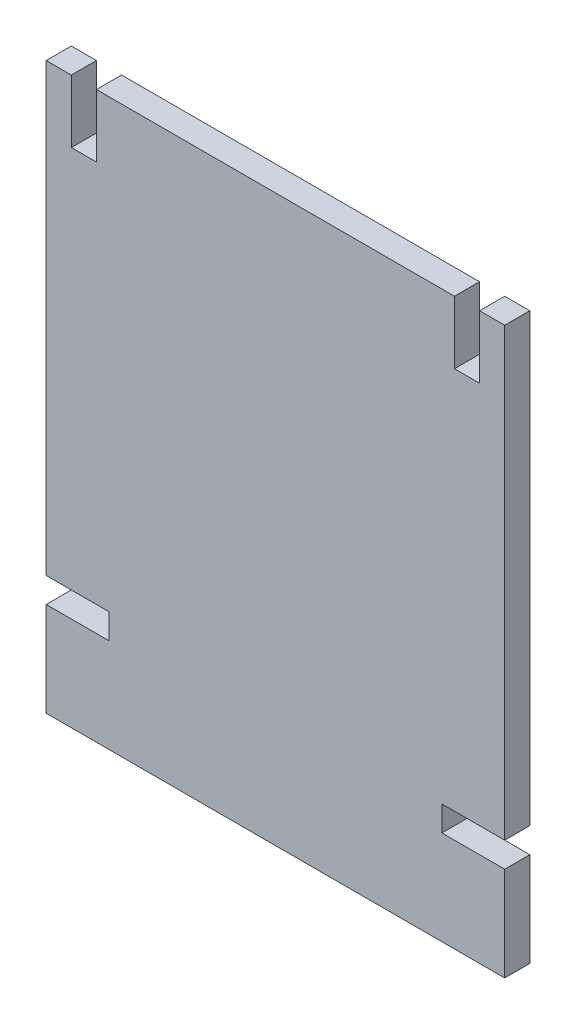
ISO-10303-21;
HEADER;
FILE_DESCRIPTION(('STEP AP214'),'2;1');
FILE_NAME('part.step','',(''),(''),'','','');
FILE_SCHEMA(('AUTOMOTIVE_DESIGN { 1 0 10303 214 1 1 1 1 }'));
ENDSEC;
DATA;
#1=APPLICATION_CONTEXT('core data for automotive mechanical design processes');
#2=APPLICATION_PROTOCOL_DEFINITION('international standard','automotive_design',2000,#1);
#3=PRODUCT_CONTEXT('',#1,'mechanical');
#4=PRODUCT('Part','Part','',(#3));
#5=PRODUCT_RELATED_PRODUCT_CATEGORY('part','',(#4));
#6=PRODUCT_DEFINITION_FORMATION('','',#4);
#7=PRODUCT_DEFINITION_CONTEXT('part definition',#1,'design');
#8=PRODUCT_DEFINITION('design','',#6,#7);
#9=PRODUCT_DEFINITION_SHAPE('','',#8);
#10=(LENGTH_UNIT() NAMED_UNIT(*) SI_UNIT(.MILLI.,.METRE.));
#11=(NAMED_UNIT(*) PLANE_ANGLE_UNIT() SI_UNIT($,.RADIAN.));
#12=(NAMED_UNIT(*) SI_UNIT($,.STERADIAN.) SOLID_ANGLE_UNIT());
#13=UNCERTAINTY_MEASURE_WITH_UNIT(LENGTH_MEASURE(1.E-05),#10,'distance_accuracy_value','');
#14=(GEOMETRIC_REPRESENTATION_CONTEXT(3) GLOBAL_UNCERTAINTY_ASSIGNED_CONTEXT((#13)) GLOBAL_UNIT_ASSIGNED_CONTEXT((#10,
#11,#12)) REPRESENTATION_CONTEXT('',''));
#15=CARTESIAN_POINT('',(0.,0.,0.));
#16=DIRECTION('',(0.,0.,1.));
#17=DIRECTION('',(1.,0.,0.));
#18=AXIS2_PLACEMENT_3D('',#15,#16,#17);
#19=CARTESIAN_POINT('',(36.5,-30.,4.));
#20=DIRECTION('',(-1.,0.,0.));
#21=DIRECTION('',(0.,-1.,0.));
#22=AXIS2_PLACEMENT_3D('',#19,#20,#21);
#23=PLANE('',#22);
#24=DIRECTION('',(0.,1.,0.));
#25=VECTOR('',#24,1.);
#26=CARTESIAN_POINT('',(36.5,-30.,0.));
#27=LINE('',#26,#25);
#28=CARTESIAN_POINT('',(36.5,-45.,0.));
#29=VERTEX_POINT('',#28);
#30=CARTESIAN_POINT('',(36.5,-30.,0.));
#31=VERTEX_POINT('',#30);
#32=EDGE_CURVE('E199',#29,#31,#27,.T.);
#33=ORIENTED_EDGE('',*,*,#32,.T.);
#34=DIRECTION('',(0.,0.,-1.));
#35=VECTOR('',#34,1.);
#36=CARTESIAN_POINT('',(36.5,-30.,4.));
#37=LINE('',#36,#35);
#38=CARTESIAN_POINT('',(36.5,-30.,4.));
#39=VERTEX_POINT('',#38);
#40=EDGE_CURVE('E11',#39,#31,#37,.T.);
#41=ORIENTED_EDGE('',*,*,#40,.F.);
#42=DIRECTION('',(0.,1.,0.));
#43=VECTOR('',#42,1.);
#44=CARTESIAN_POINT('',(36.5,-30.,4.));
#45=LINE('',#44,#43);
#46=CARTESIAN_POINT('',(36.5,-45.,4.));
#47=VERTEX_POINT('',#46);
#48=EDGE_CURVE('E237',#47,#39,#45,.T.);
#49=ORIENTED_EDGE('',*,*,#48,.F.);
#50=DIRECTION('',(0.,0.,-1.));
#51=VECTOR('',#50,1.);
#52=CARTESIAN_POINT('',(36.5,-45.,4.));
#53=LINE('',#52,#51);
#54=EDGE_CURVE('E195',#47,#29,#53,.T.);
#55=ORIENTED_EDGE('',*,*,#54,.T.);
#56=EDGE_LOOP('',(#33,#41,#49,#55));
#57=FACE_BOUND('',#56,.T.);
#58=ADVANCED_FACE('F31',(#57),#23,.F.);
#59=CARTESIAN_POINT('',(36.5,-30.,4.));
#60=DIRECTION('',(0.,-1.,0.));
#61=DIRECTION('',(0.,0.,-1.));
#62=AXIS2_PLACEMENT_3D('',#59,#60,#61);
#63=PLANE('',#62);
#64=DIRECTION('',(-1.,0.,0.));
#65=VECTOR('',#64,1.);
#66=CARTESIAN_POINT('',(36.5,-30.,0.));
#67=LINE('',#66,#65);
#68=CARTESIAN_POINT('',(26.5,-30.,0.));
#69=VERTEX_POINT('',#68);
#70=EDGE_CURVE('E202',#31,#69,#67,.T.);
#71=ORIENTED_EDGE('',*,*,#70,.T.);
#72=DIRECTION('',(0.,0.,-1.));
#73=VECTOR('',#72,1.);
#74=CARTESIAN_POINT('',(26.5,-30.,4.));
#75=LINE('',#74,#73);
#76=CARTESIAN_POINT('',(26.5,-30.,4.));
#77=VERTEX_POINT('',#76);
#78=EDGE_CURVE('E39',#77,#69,#75,.T.);
#79=ORIENTED_EDGE('',*,*,#78,.F.);
#80=DIRECTION('',(-1.,0.,0.));
#81=VECTOR('',#80,1.);
#82=CARTESIAN_POINT('',(36.5,-30.,4.));
#83=LINE('',#82,#81);
#84=EDGE_CURVE('E126',#39,#77,#83,.T.);
#85=ORIENTED_EDGE('',*,*,#84,.F.);
#86=ORIENTED_EDGE('',*,*,#40,.T.);
#87=EDGE_LOOP('',(#71,#79,#85,#86));
#88=FACE_BOUND('',#87,.T.);
#89=ADVANCED_FACE('F355',(#88),#63,.F.);
#90=CARTESIAN_POINT('',(26.5,-26.,4.));
#91=DIRECTION('',(-1.,0.,0.));
#92=DIRECTION('',(0.,0.,1.));
#93=AXIS2_PLACEMENT_3D('',#90,#91,#92);
#94=PLANE('',#93);
#95=DIRECTION('',(0.,1.,0.));
#96=VECTOR('',#95,1.);
#97=CARTESIAN_POINT('',(26.5,-26.,0.));
#98=LINE('',#97,#96);
#99=CARTESIAN_POINT('',(26.5,-26.,0.));
#100=VERTEX_POINT('',#99);
#101=EDGE_CURVE('E204',#69,#100,#98,.T.);
#102=ORIENTED_EDGE('',*,*,#101,.T.);
#103=DIRECTION('',(0.,0.,-1.));
#104=VECTOR('',#103,1.);
#105=CARTESIAN_POINT('',(26.5,-26.,4.));
#106=LINE('',#105,#104);
#107=CARTESIAN_POINT('',(26.5,-26.,4.));
#108=VERTEX_POINT('',#107);
#109=EDGE_CURVE('E280',#108,#100,#106,.T.);
#110=ORIENTED_EDGE('',*,*,#109,.F.);
#111=DIRECTION('',(0.,1.,0.));
#112=VECTOR('',#111,1.);
#113=CARTESIAN_POINT('',(26.5,-26.,4.));
#114=LINE('',#113,#112);
#115=EDGE_CURVE('E288',#77,#108,#114,.T.);
#116=ORIENTED_EDGE('',*,*,#115,.F.);
#117=ORIENTED_EDGE('',*,*,#78,.T.);
#118=EDGE_LOOP('',(#102,#110,#116,#117));
#119=FACE_BOUND('',#118,.T.);
#120=ADVANCED_FACE('F286',(#119),#94,.F.);
#121=CARTESIAN_POINT('',(36.5,-26.,4.));
#122=DIRECTION('',(0.,1.,0.));
#123=DIRECTION('',(0.,0.,1.));
#124=AXIS2_PLACEMENT_3D('',#121,#122,#123);
#125=PLANE('',#124);
#126=DIRECTION('',(1.,0.,0.));
#127=VECTOR('',#126,1.);
#128=CARTESIAN_POINT('',(36.5,-26.,0.));
#129=LINE('',#128,#127);
#130=CARTESIAN_POINT('',(36.5,-26.,0.));
#131=VERTEX_POINT('',#130);
#132=EDGE_CURVE('E206',#100,#131,#129,.T.);
#133=ORIENTED_EDGE('',*,*,#132,.T.);
#134=DIRECTION('',(0.,0.,-1.));
#135=VECTOR('',#134,1.);
#136=CARTESIAN_POINT('',(36.5,-26.,4.));
#137=LINE('',#136,#135);
#138=CARTESIAN_POINT('',(36.5,-26.,4.));
#139=VERTEX_POINT('',#138);
#140=EDGE_CURVE('E277',#139,#131,#137,.T.);
#141=ORIENTED_EDGE('',*,*,#140,.F.);
#142=DIRECTION('',(1.,0.,0.));
#143=VECTOR('',#142,1.);
#144=CARTESIAN_POINT('',(36.5,-26.,4.));
#145=LINE('',#144,#143);
#146=EDGE_CURVE('E306',#108,#139,#145,.T.);
#147=ORIENTED_EDGE('',*,*,#146,.F.);
#148=ORIENTED_EDGE('',*,*,#109,.T.);
#149=EDGE_LOOP('',(#133,#141,#147,#148));
#150=FACE_BOUND('',#149,.T.);
#151=ADVANCED_FACE('F297',(#150),#125,.F.);
#152=CARTESIAN_POINT('',(36.5,45.,4.));
#153=DIRECTION('',(-1.,0.,0.));
#154=DIRECTION('',(0.,-1.,0.));
#155=AXIS2_PLACEMENT_3D('',#152,#153,#154);
#156=PLANE('',#155);
#157=DIRECTION('',(0.,1.,0.));
#158=VECTOR('',#157,1.);
#159=CARTESIAN_POINT('',(36.5,45.,0.));
#160=LINE('',#159,#158);
#161=CARTESIAN_POINT('',(36.5,45.,0.));
#162=VERTEX_POINT('',#161);
#163=EDGE_CURVE('E208',#131,#162,#160,.T.);
#164=ORIENTED_EDGE('',*,*,#163,.T.);
#165=DIRECTION('',(0.,0.,-1.));
#166=VECTOR('',#165,1.);
#167=CARTESIAN_POINT('',(36.5,45.,4.));
#168=LINE('',#167,#166);
#169=CARTESIAN_POINT('',(36.5,45.,4.));
#170=VERTEX_POINT('',#169);
#171=EDGE_CURVE('E274',#170,#162,#168,.T.);
#172=ORIENTED_EDGE('',*,*,#171,.F.);
#173=DIRECTION('',(0.,1.,0.));
#174=VECTOR('',#173,1.);
#175=CARTESIAN_POINT('',(36.5,45.,4.));
#176=LINE('',#175,#174);
#177=EDGE_CURVE('E303',#139,#170,#176,.T.);
#178=ORIENTED_EDGE('',*,*,#177,.F.);
#179=ORIENTED_EDGE('',*,*,#140,.T.);
#180=EDGE_LOOP('',(#164,#172,#178,#179));
#181=FACE_BOUND('',#180,.T.);
#182=ADVANCED_FACE('F301',(#181),#156,.F.);
#183=CARTESIAN_POINT('',(32.5,45.,4.));
#184=DIRECTION('',(0.,-1.,0.));
#185=DIRECTION('',(0.,0.,-1.));
#186=AXIS2_PLACEMENT_3D('',#183,#184,#185);
#187=PLANE('',#186);
#188=DIRECTION('',(-1.,0.,0.));
#189=VECTOR('',#188,1.);
#190=CARTESIAN_POINT('',(32.5,45.,0.));
#191=LINE('',#190,#189);
#192=CARTESIAN_POINT('',(32.5,45.,0.));
#193=VERTEX_POINT('',#192);
#194=EDGE_CURVE('E210',#162,#193,#191,.T.);
#195=ORIENTED_EDGE('',*,*,#194,.T.);
#196=DIRECTION('',(0.,0.,-1.));
#197=VECTOR('',#196,1.);
#198=CARTESIAN_POINT('',(32.5,45.,4.));
#199=LINE('',#198,#197);
#200=CARTESIAN_POINT('',(32.5,45.,4.));
#201=VERTEX_POINT('',#200);
#202=EDGE_CURVE('E271',#201,#193,#199,.T.);
#203=ORIENTED_EDGE('',*,*,#202,.F.);
#204=DIRECTION('',(-1.,0.,0.));
#205=VECTOR('',#204,1.);
#206=CARTESIAN_POINT('',(32.5,45.,4.));
#207=LINE('',#206,#205);
#208=EDGE_CURVE('E305',#170,#201,#207,.T.);
#209=ORIENTED_EDGE('',*,*,#208,.F.);
#210=ORIENTED_EDGE('',*,*,#171,.T.);
#211=EDGE_LOOP('',(#195,#203,#209,#210));
#212=FACE_BOUND('',#211,.T.);
#213=ADVANCED_FACE('F368',(#212),#187,.F.);
#214=CARTESIAN_POINT('',(32.5,45.,4.));
#215=DIRECTION('',(1.,0.,0.));
#216=DIRECTION('',(0.,1.,0.));
#217=AXIS2_PLACEMENT_3D('',#214,#215,#216);
#218=PLANE('',#217);
#219=DIRECTION('',(0.,-1.,0.));
#220=VECTOR('',#219,1.);
#221=CARTESIAN_POINT('',(32.5,45.,0.));
#222=LINE('',#221,#220);
#223=CARTESIAN_POINT('',(32.5,35.,0.));
#224=VERTEX_POINT('',#223);
#225=EDGE_CURVE('E212',#193,#224,#222,.T.);
#226=ORIENTED_EDGE('',*,*,#225,.T.);
#227=DIRECTION('',(0.,0.,-1.));
#228=VECTOR('',#227,1.);
#229=CARTESIAN_POINT('',(32.5,35.,4.));
#230=LINE('',#229,#228);
#231=CARTESIAN_POINT('',(32.5,35.,4.));
#232=VERTEX_POINT('',#231);
#233=EDGE_CURVE('E268',#232,#224,#230,.T.);
#234=ORIENTED_EDGE('',*,*,#233,.F.);
#235=DIRECTION('',(0.,-1.,0.));
#236=VECTOR('',#235,1.);
#237=CARTESIAN_POINT('',(32.5,45.,4.));
#238=LINE('',#237,#236);
#239=EDGE_CURVE('E308',#201,#232,#238,.T.);
#240=ORIENTED_EDGE('',*,*,#239,.F.);
#241=ORIENTED_EDGE('',*,*,#202,.T.);
#242=EDGE_LOOP('',(#226,#234,#240,#241));
#243=FACE_BOUND('',#242,.T.);
#244=ADVANCED_FACE('F371',(#243),#218,.F.);
#245=CARTESIAN_POINT('',(28.5,35.,4.));
#246=DIRECTION('',(0.,-1.,0.));
#247=DIRECTION('',(1.,0.,0.));
#248=AXIS2_PLACEMENT_3D('',#245,#246,#247);
#249=PLANE('',#248);
#250=DIRECTION('',(-1.,0.,0.));
#251=VECTOR('',#250,1.);
#252=CARTESIAN_POINT('',(28.5,35.,0.));
#253=LINE('',#252,#251);
#254=CARTESIAN_POINT('',(28.5,35.,0.));
#255=VERTEX_POINT('',#254);
#256=EDGE_CURVE('E214',#224,#255,#253,.T.);
#257=ORIENTED_EDGE('',*,*,#256,.T.);
#258=DIRECTION('',(0.,0.,-1.));
#259=VECTOR('',#258,1.);
#260=CARTESIAN_POINT('',(28.5,35.,4.));
#261=LINE('',#260,#259);
#262=CARTESIAN_POINT('',(28.5,35.,4.));
#263=VERTEX_POINT('',#262);
#264=EDGE_CURVE('E265',#263,#255,#261,.T.);
#265=ORIENTED_EDGE('',*,*,#264,.F.);
#266=DIRECTION('',(-1.,0.,0.));
#267=VECTOR('',#266,1.);
#268=CARTESIAN_POINT('',(28.5,35.,4.));
#269=LINE('',#268,#267);
#270=EDGE_CURVE('E314',#232,#263,#269,.T.);
#271=ORIENTED_EDGE('',*,*,#270,.F.);
#272=ORIENTED_EDGE('',*,*,#233,.T.);
#273=EDGE_LOOP('',(#257,#265,#271,#272));
#274=FACE_BOUND('',#273,.T.);
#275=ADVANCED_FACE('F375',(#274),#249,.F.);
#276=CARTESIAN_POINT('',(28.5,45.,4.));
#277=DIRECTION('',(-1.,0.,0.));
#278=DIRECTION('',(0.,-1.,0.));
#279=AXIS2_PLACEMENT_3D('',#276,#277,#278);
#280=PLANE('',#279);
#281=DIRECTION('',(0.,1.,0.));
#282=VECTOR('',#281,1.);
#283=CARTESIAN_POINT('',(28.5,45.,0.));
#284=LINE('',#283,#282);
#285=CARTESIAN_POINT('',(28.5,45.,0.));
#286=VERTEX_POINT('',#285);
#287=EDGE_CURVE('E216',#255,#286,#284,.T.);
#288=ORIENTED_EDGE('',*,*,#287,.T.);
#289=DIRECTION('',(0.,0.,-1.));
#290=VECTOR('',#289,1.);
#291=CARTESIAN_POINT('',(28.5,45.,4.));
#292=LINE('',#291,#290);
#293=CARTESIAN_POINT('',(28.5,45.,4.));
#294=VERTEX_POINT('',#293);
#295=EDGE_CURVE('E262',#294,#286,#292,.T.);
#296=ORIENTED_EDGE('',*,*,#295,.F.);
#297=DIRECTION('',(0.,1.,0.));
#298=VECTOR('',#297,1.);
#299=CARTESIAN_POINT('',(28.5,45.,4.));
#300=LINE('',#299,#298);
#301=EDGE_CURVE('E316',#263,#294,#300,.T.);
#302=ORIENTED_EDGE('',*,*,#301,.F.);
#303=ORIENTED_EDGE('',*,*,#264,.T.);
#304=EDGE_LOOP('',(#288,#296,#302,#303));
#305=FACE_BOUND('',#304,.T.);
#306=ADVANCED_FACE('F379',(#305),#280,.F.);
#307=CARTESIAN_POINT('',(-28.5,45.,4.));
#308=DIRECTION('',(0.,-1.,0.));
#309=DIRECTION('',(0.,0.,-1.));
#310=AXIS2_PLACEMENT_3D('',#307,#308,#309);
#311=PLANE('',#310);
#312=DIRECTION('',(-1.,0.,0.));
#313=VECTOR('',#312,1.);
#314=CARTESIAN_POINT('',(-28.5,45.,0.));
#315=LINE('',#314,#313);
#316=CARTESIAN_POINT('',(-28.5,45.,0.));
#317=VERTEX_POINT('',#316);
#318=EDGE_CURVE('E218',#286,#317,#315,.T.);
#319=ORIENTED_EDGE('',*,*,#318,.T.);
#320=DIRECTION('',(0.,0.,-1.));
#321=VECTOR('',#320,1.);
#322=CARTESIAN_POINT('',(-28.5,45.,4.));
#323=LINE('',#322,#321);
#324=CARTESIAN_POINT('',(-28.5,45.,4.));
#325=VERTEX_POINT('',#324);
#326=EDGE_CURVE('E259',#325,#317,#323,.T.);
#327=ORIENTED_EDGE('',*,*,#326,.F.);
#328=DIRECTION('',(-1.,0.,0.));
#329=VECTOR('',#328,1.);
#330=CARTESIAN_POINT('',(-28.5,45.,4.));
#331=LINE('',#330,#329);
#332=EDGE_CURVE('E318',#294,#325,#331,.T.);
#333=ORIENTED_EDGE('',*,*,#332,.F.);
#334=ORIENTED_EDGE('',*,*,#295,.T.);
#335=EDGE_LOOP('',(#319,#327,#333,#334));
#336=FACE_BOUND('',#335,.T.);
#337=ADVANCED_FACE('F383',(#336),#311,.F.);
#338=CARTESIAN_POINT('',(-28.5,45.,4.));
#339=DIRECTION('',(1.,0.,0.));
#340=DIRECTION('',(0.,1.,0.));
#341=AXIS2_PLACEMENT_3D('',#338,#339,#340);
#342=PLANE('',#341);
#343=DIRECTION('',(0.,-1.,0.));
#344=VECTOR('',#343,1.);
#345=CARTESIAN_POINT('',(-28.5,45.,0.));
#346=LINE('',#345,#344);
#347=CARTESIAN_POINT('',(-28.5,35.,0.));
#348=VERTEX_POINT('',#347);
#349=EDGE_CURVE('E220',#317,#348,#346,.T.);
#350=ORIENTED_EDGE('',*,*,#349,.T.);
#351=DIRECTION('',(0.,0.,-1.));
#352=VECTOR('',#351,1.);
#353=CARTESIAN_POINT('',(-28.5,35.,4.));
#354=LINE('',#353,#352);
#355=CARTESIAN_POINT('',(-28.5,35.,4.));
#356=VERTEX_POINT('',#355);
#357=EDGE_CURVE('E256',#356,#348,#354,.T.);
#358=ORIENTED_EDGE('',*,*,#357,.F.);
#359=DIRECTION('',(0.,-1.,0.));
#360=VECTOR('',#359,1.);
#361=CARTESIAN_POINT('',(-28.5,45.,4.));
#362=LINE('',#361,#360);
#363=EDGE_CURVE('E320',#325,#356,#362,.T.);
#364=ORIENTED_EDGE('',*,*,#363,.F.);
#365=ORIENTED_EDGE('',*,*,#326,.T.);
#366=EDGE_LOOP('',(#350,#358,#364,#365));
#367=FACE_BOUND('',#366,.T.);
#368=ADVANCED_FACE('F387',(#367),#342,.F.);
#369=CARTESIAN_POINT('',(-32.5,35.,4.));
#370=DIRECTION('',(0.,-1.,0.));
#371=DIRECTION('',(0.,0.,-1.));
#372=AXIS2_PLACEMENT_3D('',#369,#370,#371);
#373=PLANE('',#372);
#374=DIRECTION('',(-1.,0.,0.));
#375=VECTOR('',#374,1.);
#376=CARTESIAN_POINT('',(-32.5,35.,0.));
#377=LINE('',#376,#375);
#378=CARTESIAN_POINT('',(-32.5,35.,0.));
#379=VERTEX_POINT('',#378);
#380=EDGE_CURVE('E222',#348,#379,#377,.T.);
#381=ORIENTED_EDGE('',*,*,#380,.T.);
#382=DIRECTION('',(0.,0.,-1.));
#383=VECTOR('',#382,1.);
#384=CARTESIAN_POINT('',(-32.5,35.,4.));
#385=LINE('',#384,#383);
#386=CARTESIAN_POINT('',(-32.5,35.,4.));
#387=VERTEX_POINT('',#386);
#388=EDGE_CURVE('E253',#387,#379,#385,.T.);
#389=ORIENTED_EDGE('',*,*,#388,.F.);
#390=DIRECTION('',(-1.,0.,0.));
#391=VECTOR('',#390,1.);
#392=CARTESIAN_POINT('',(-32.5,35.,4.));
#393=LINE('',#392,#391);
#394=EDGE_CURVE('E322',#356,#387,#393,.T.);
#395=ORIENTED_EDGE('',*,*,#394,.F.);
#396=ORIENTED_EDGE('',*,*,#357,.T.);
#397=EDGE_LOOP('',(#381,#389,#395,#396));
#398=FACE_BOUND('',#397,.T.);
#399=ADVANCED_FACE('F391',(#398),#373,.F.);
#400=CARTESIAN_POINT('',(-32.5,45.,4.));
#401=DIRECTION('',(-1.,0.,0.));
#402=DIRECTION('',(0.,0.,1.));
#403=AXIS2_PLACEMENT_3D('',#400,#401,#402);
#404=PLANE('',#403);
#405=DIRECTION('',(0.,1.,0.));
#406=VECTOR('',#405,1.);
#407=CARTESIAN_POINT('',(-32.5,45.,0.));
#408=LINE('',#407,#406);
#409=CARTESIAN_POINT('',(-32.5,45.,0.));
#410=VERTEX_POINT('',#409);
#411=EDGE_CURVE('E224',#379,#410,#408,.T.);
#412=ORIENTED_EDGE('',*,*,#411,.T.);
#413=DIRECTION('',(0.,0.,-1.));
#414=VECTOR('',#413,1.);
#415=CARTESIAN_POINT('',(-32.5,45.,4.));
#416=LINE('',#415,#414);
#417=CARTESIAN_POINT('',(-32.5,45.,4.));
#418=VERTEX_POINT('',#417);
#419=EDGE_CURVE('E250',#418,#410,#416,.T.);
#420=ORIENTED_EDGE('',*,*,#419,.F.);
#421=DIRECTION('',(0.,1.,0.));
#422=VECTOR('',#421,1.);
#423=CARTESIAN_POINT('',(-32.5,45.,4.));
#424=LINE('',#423,#422);
#425=EDGE_CURVE('E324',#387,#418,#424,.T.);
#426=ORIENTED_EDGE('',*,*,#425,.F.);
#427=ORIENTED_EDGE('',*,*,#388,.T.);
#428=EDGE_LOOP('',(#412,#420,#426,#427));
#429=FACE_BOUND('',#428,.T.);
#430=ADVANCED_FACE('F395',(#429),#404,.F.);
#431=CARTESIAN_POINT('',(-36.5,45.,4.));
#432=DIRECTION('',(0.,-1.,0.));
#433=DIRECTION('',(0.,0.,-1.));
#434=AXIS2_PLACEMENT_3D('',#431,#432,#433);
#435=PLANE('',#434);
#436=DIRECTION('',(-1.,0.,0.));
#437=VECTOR('',#436,1.);
#438=CARTESIAN_POINT('',(-36.5,45.,0.));
#439=LINE('',#438,#437);
#440=CARTESIAN_POINT('',(-36.5,45.,0.));
#441=VERTEX_POINT('',#440);
#442=EDGE_CURVE('E226',#410,#441,#439,.T.);
#443=ORIENTED_EDGE('',*,*,#442,.T.);
#444=DIRECTION('',(0.,0.,-1.));
#445=VECTOR('',#444,1.);
#446=CARTESIAN_POINT('',(-36.5,45.,4.));
#447=LINE('',#446,#445);
#448=CARTESIAN_POINT('',(-36.5,45.,4.));
#449=VERTEX_POINT('',#448);
#450=EDGE_CURVE('E247',#449,#441,#447,.T.);
#451=ORIENTED_EDGE('',*,*,#450,.F.);
#452=DIRECTION('',(-1.,0.,0.));
#453=VECTOR('',#452,1.);
#454=CARTESIAN_POINT('',(-36.5,45.,4.));
#455=LINE('',#454,#453);
#456=EDGE_CURVE('E326',#418,#449,#455,.T.);
#457=ORIENTED_EDGE('',*,*,#456,.F.);
#458=ORIENTED_EDGE('',*,*,#419,.T.);
#459=EDGE_LOOP('',(#443,#451,#457,#458));
#460=FACE_BOUND('',#459,.T.);
#461=ADVANCED_FACE('F399',(#460),#435,.F.);
#462=CARTESIAN_POINT('',(-36.5,45.,4.));
#463=DIRECTION('',(1.,0.,0.));
#464=DIRECTION('',(0.,1.,0.));
#465=AXIS2_PLACEMENT_3D('',#462,#463,#464);
#466=PLANE('',#465);
#467=DIRECTION('',(0.,-1.,0.));
#468=VECTOR('',#467,1.);
#469=CARTESIAN_POINT('',(-36.5,45.,0.));
#470=LINE('',#469,#468);
#471=CARTESIAN_POINT('',(-36.5,-26.,0.));
#472=VERTEX_POINT('',#471);
#473=EDGE_CURVE('E228',#441,#472,#470,.T.);
#474=ORIENTED_EDGE('',*,*,#473,.T.);
#475=DIRECTION('',(0.,0.,-1.));
#476=VECTOR('',#475,1.);
#477=CARTESIAN_POINT('',(-36.5,-26.,4.));
#478=LINE('',#477,#476);
#479=CARTESIAN_POINT('',(-36.5,-26.,4.));
#480=VERTEX_POINT('',#479);
#481=EDGE_CURVE('E244',#480,#472,#478,.T.);
#482=ORIENTED_EDGE('',*,*,#481,.F.);
#483=DIRECTION('',(0.,-1.,0.));
#484=VECTOR('',#483,1.);
#485=CARTESIAN_POINT('',(-36.5,45.,4.));
#486=LINE('',#485,#484);
#487=EDGE_CURVE('E328',#449,#480,#486,.T.);
#488=ORIENTED_EDGE('',*,*,#487,.F.);
#489=ORIENTED_EDGE('',*,*,#450,.T.);
#490=EDGE_LOOP('',(#474,#482,#488,#489));
#491=FACE_BOUND('',#490,.T.);
#492=ADVANCED_FACE('F403',(#491),#466,.F.);
#493=CARTESIAN_POINT('',(-36.5,-26.,4.));
#494=DIRECTION('',(0.,1.,0.));
#495=DIRECTION('',(0.,0.,1.));
#496=AXIS2_PLACEMENT_3D('',#493,#494,#495);
#497=PLANE('',#496);
#498=DIRECTION('',(1.,0.,0.));
#499=VECTOR('',#498,1.);
#500=CARTESIAN_POINT('',(-36.5,-26.,0.));
#501=LINE('',#500,#499);
#502=CARTESIAN_POINT('',(-26.5,-26.,0.));
#503=VERTEX_POINT('',#502);
#504=EDGE_CURVE('E230',#472,#503,#501,.T.);
#505=ORIENTED_EDGE('',*,*,#504,.T.);
#506=DIRECTION('',(0.,0.,-1.));
#507=VECTOR('',#506,1.);
#508=CARTESIAN_POINT('',(-26.5,-26.,4.));
#509=LINE('',#508,#507);
#510=CARTESIAN_POINT('',(-26.5,-26.,4.));
#511=VERTEX_POINT('',#510);
#512=EDGE_CURVE('E241',#511,#503,#509,.T.);
#513=ORIENTED_EDGE('',*,*,#512,.F.);
#514=DIRECTION('',(1.,0.,0.));
#515=VECTOR('',#514,1.);
#516=CARTESIAN_POINT('',(-36.5,-26.,4.));
#517=LINE('',#516,#515);
#518=EDGE_CURVE('E330',#480,#511,#517,.T.);
#519=ORIENTED_EDGE('',*,*,#518,.F.);
#520=ORIENTED_EDGE('',*,*,#481,.T.);
#521=EDGE_LOOP('',(#505,#513,#519,#520));
#522=FACE_BOUND('',#521,.T.);
#523=ADVANCED_FACE('F336',(#522),#497,.F.);
#524=CARTESIAN_POINT('',(-26.5,-26.,4.));
#525=DIRECTION('',(1.,0.,0.));
#526=DIRECTION('',(0.,0.,-1.));
#527=AXIS2_PLACEMENT_3D('',#524,#525,#526);
#528=PLANE('',#527);
#529=DIRECTION('',(0.,-1.,0.));
#530=VECTOR('',#529,1.);
#531=CARTESIAN_POINT('',(-26.5,-26.,0.));
#532=LINE('',#531,#530);
#533=CARTESIAN_POINT('',(-26.5,-30.,0.));
#534=VERTEX_POINT('',#533);
#535=EDGE_CURVE('E232',#503,#534,#532,.T.);
#536=ORIENTED_EDGE('',*,*,#535,.T.);
#537=DIRECTION('',(0.,0.,-1.));
#538=VECTOR('',#537,1.);
#539=CARTESIAN_POINT('',(-26.5,-30.,4.));
#540=LINE('',#539,#538);
#541=CARTESIAN_POINT('',(-26.5,-30.,4.));
#542=VERTEX_POINT('',#541);
#543=EDGE_CURVE('E190',#542,#534,#540,.T.);
#544=ORIENTED_EDGE('',*,*,#543,.F.);
#545=DIRECTION('',(0.,-1.,0.));
#546=VECTOR('',#545,1.);
#547=CARTESIAN_POINT('',(-26.5,-26.,4.));
#548=LINE('',#547,#546);
#549=EDGE_CURVE('E181',#511,#542,#548,.T.);
#550=ORIENTED_EDGE('',*,*,#549,.F.);
#551=ORIENTED_EDGE('',*,*,#512,.T.);
#552=EDGE_LOOP('',(#536,#544,#550,#551));
#553=FACE_BOUND('',#552,.T.);
#554=ADVANCED_FACE('F340',(#553),#528,.F.);
#555=CARTESIAN_POINT('',(-36.5,-30.,4.));
#556=DIRECTION('',(0.,-1.,0.));
#557=DIRECTION('',(0.,0.,-1.));
#558=AXIS2_PLACEMENT_3D('',#555,#556,#557);
#559=PLANE('',#558);
#560=DIRECTION('',(-1.,0.,0.));
#561=VECTOR('',#560,1.);
#562=CARTESIAN_POINT('',(-36.5,-30.,0.));
#563=LINE('',#562,#561);
#564=CARTESIAN_POINT('',(-36.5,-30.,0.));
#565=VERTEX_POINT('',#564);
#566=EDGE_CURVE('E189',#534,#565,#563,.T.);
#567=ORIENTED_EDGE('',*,*,#566,.T.);
#568=DIRECTION('',(0.,0.,-1.));
#569=VECTOR('',#568,1.);
#570=CARTESIAN_POINT('',(-36.5,-30.,4.));
#571=LINE('',#570,#569);
#572=CARTESIAN_POINT('',(-36.5,-30.,4.));
#573=VERTEX_POINT('',#572);
#574=EDGE_CURVE('E186',#573,#565,#571,.T.);
#575=ORIENTED_EDGE('',*,*,#574,.F.);
#576=DIRECTION('',(-1.,0.,0.));
#577=VECTOR('',#576,1.);
#578=CARTESIAN_POINT('',(-36.5,-30.,4.));
#579=LINE('',#578,#577);
#580=EDGE_CURVE('E175',#542,#573,#579,.T.);
#581=ORIENTED_EDGE('',*,*,#580,.F.);
#582=ORIENTED_EDGE('',*,*,#543,.T.);
#583=EDGE_LOOP('',(#567,#575,#581,#582));
#584=FACE_BOUND('',#583,.T.);
#585=ADVANCED_FACE('F187',(#584),#559,.F.);
#586=CARTESIAN_POINT('',(-36.5,-30.,4.));
#587=DIRECTION('',(1.,0.,0.));
#588=DIRECTION('',(0.,1.,0.));
#589=AXIS2_PLACEMENT_3D('',#586,#587,#588);
#590=PLANE('',#589);
#591=DIRECTION('',(0.,-1.,0.));
#592=VECTOR('',#591,1.);
#593=CARTESIAN_POINT('',(-36.5,-30.,0.));
#594=LINE('',#593,#592);
#595=CARTESIAN_POINT('',(-36.5,-45.,0.));
#596=VERTEX_POINT('',#595);
#597=EDGE_CURVE('E112',#565,#596,#594,.T.);
#598=ORIENTED_EDGE('',*,*,#597,.T.);
#599=DIRECTION('',(0.,0.,-1.));
#600=VECTOR('',#599,1.);
#601=CARTESIAN_POINT('',(-36.5,-45.,4.));
#602=LINE('',#601,#600);
#603=CARTESIAN_POINT('',(-36.5,-45.,4.));
#604=VERTEX_POINT('',#603);
#605=EDGE_CURVE('E191',#604,#596,#602,.T.);
#606=ORIENTED_EDGE('',*,*,#605,.F.);
#607=DIRECTION('',(0.,-1.,0.));
#608=VECTOR('',#607,1.);
#609=CARTESIAN_POINT('',(-36.5,-30.,4.));
#610=LINE('',#609,#608);
#611=EDGE_CURVE('E179',#573,#604,#610,.T.);
#612=ORIENTED_EDGE('',*,*,#611,.F.);
#613=ORIENTED_EDGE('',*,*,#574,.T.);
#614=EDGE_LOOP('',(#598,#606,#612,#613));
#615=FACE_BOUND('',#614,.T.);
#616=ADVANCED_FACE('F193',(#615),#590,.F.);
#617=CARTESIAN_POINT('',(-36.5,-45.,4.));
#618=DIRECTION('',(0.,1.,0.));
#619=DIRECTION('',(0.,0.,1.));
#620=AXIS2_PLACEMENT_3D('',#617,#618,#619);
#621=PLANE('',#620);
#622=DIRECTION('',(1.,0.,0.));
#623=VECTOR('',#622,1.);
#624=CARTESIAN_POINT('',(-36.5,-45.,0.));
#625=LINE('',#624,#623);
#626=EDGE_CURVE('E118',#596,#29,#625,.T.);
#627=ORIENTED_EDGE('',*,*,#626,.T.);
#628=ORIENTED_EDGE('',*,*,#54,.F.);
#629=DIRECTION('',(1.,0.,0.));
#630=VECTOR('',#629,1.);
#631=CARTESIAN_POINT('',(-36.5,-45.,4.));
#632=LINE('',#631,#630);
#633=EDGE_CURVE('E47',#604,#47,#632,.T.);
#634=ORIENTED_EDGE('',*,*,#633,.F.);
#635=ORIENTED_EDGE('',*,*,#605,.T.);
#636=EDGE_LOOP('',(#627,#628,#634,#635));
#637=FACE_BOUND('',#636,.T.);
#638=ADVANCED_FACE('F344',(#637),#621,.F.);
#639=CARTESIAN_POINT('',(36.5,-45.,4.));
#640=DIRECTION('',(0.,0.,1.));
#641=DIRECTION('',(1.,0.,0.));
#642=AXIS2_PLACEMENT_3D('',#639,#640,#641);
#643=PLANE('',#642);
#644=ORIENTED_EDGE('',*,*,#48,.T.);
#645=ORIENTED_EDGE('',*,*,#84,.T.);
#646=ORIENTED_EDGE('',*,*,#115,.T.);
#647=ORIENTED_EDGE('',*,*,#146,.T.);
#648=ORIENTED_EDGE('',*,*,#177,.T.);
#649=ORIENTED_EDGE('',*,*,#208,.T.);
#650=ORIENTED_EDGE('',*,*,#239,.T.);
#651=ORIENTED_EDGE('',*,*,#270,.T.);
#652=ORIENTED_EDGE('',*,*,#301,.T.);
#653=ORIENTED_EDGE('',*,*,#332,.T.);
#654=ORIENTED_EDGE('',*,*,#363,.T.);
#655=ORIENTED_EDGE('',*,*,#394,.T.);
#656=ORIENTED_EDGE('',*,*,#425,.T.);
#657=ORIENTED_EDGE('',*,*,#456,.T.);
#658=ORIENTED_EDGE('',*,*,#487,.T.);
#659=ORIENTED_EDGE('',*,*,#518,.T.);
#660=ORIENTED_EDGE('',*,*,#549,.T.);
#661=ORIENTED_EDGE('',*,*,#580,.T.);
#662=ORIENTED_EDGE('',*,*,#611,.T.);
#663=ORIENTED_EDGE('',*,*,#633,.T.);
#664=EDGE_LOOP('',(#644,#645,#646,#647,#648,#649,#650,#651,#652,#653,#654,#655,#656,#657,#658,
#659,#660,#661,#662,#663));
#665=FACE_BOUND('',#664,.T.);
#666=ADVANCED_FACE('F177',(#665),#643,.T.);
#667=CARTESIAN_POINT('',(36.5,-45.,0.));
#668=DIRECTION('',(0.,0.,1.));
#669=DIRECTION('',(1.,0.,0.));
#670=AXIS2_PLACEMENT_3D('',#667,#668,#669);
#671=PLANE('',#670);
#672=ORIENTED_EDGE('',*,*,#32,.F.);
#673=ORIENTED_EDGE('',*,*,#626,.F.);
#674=ORIENTED_EDGE('',*,*,#597,.F.);
#675=ORIENTED_EDGE('',*,*,#566,.F.);
#676=ORIENTED_EDGE('',*,*,#535,.F.);
#677=ORIENTED_EDGE('',*,*,#504,.F.);
#678=ORIENTED_EDGE('',*,*,#473,.F.);
#679=ORIENTED_EDGE('',*,*,#442,.F.);
#680=ORIENTED_EDGE('',*,*,#411,.F.);
#681=ORIENTED_EDGE('',*,*,#380,.F.);
#682=ORIENTED_EDGE('',*,*,#349,.F.);
#683=ORIENTED_EDGE('',*,*,#318,.F.);
#684=ORIENTED_EDGE('',*,*,#287,.F.);
#685=ORIENTED_EDGE('',*,*,#256,.F.);
#686=ORIENTED_EDGE('',*,*,#225,.F.);
#687=ORIENTED_EDGE('',*,*,#194,.F.);
#688=ORIENTED_EDGE('',*,*,#163,.F.);
#689=ORIENTED_EDGE('',*,*,#132,.F.);
#690=ORIENTED_EDGE('',*,*,#101,.F.);
#691=ORIENTED_EDGE('',*,*,#70,.F.);
#692=EDGE_LOOP('',(#672,#673,#674,#675,#676,#677,#678,#679,#680,#681,#682,#683,#684,#685,#686,
#687,#688,#689,#690,#691));
#693=FACE_BOUND('',#692,.T.);
#694=ADVANCED_FACE('F292',(#693),#671,.F.);
#695=CLOSED_SHELL('',(#58,#89,#120,#151,#182,#213,#244,#275,#306,#337,#368,#399,#430,#461,#492,
#523,#554,#585,#616,#638,#666,#694));
#696=MANIFOLD_SOLID_BREP('B2',#695);
#697=ADVANCED_BREP_SHAPE_REPRESENTATION('',(#18,#696),#14);
#698=SHAPE_DEFINITION_REPRESENTATION(#9,#697);
ENDSEC;
END-ISO-10303-21;
